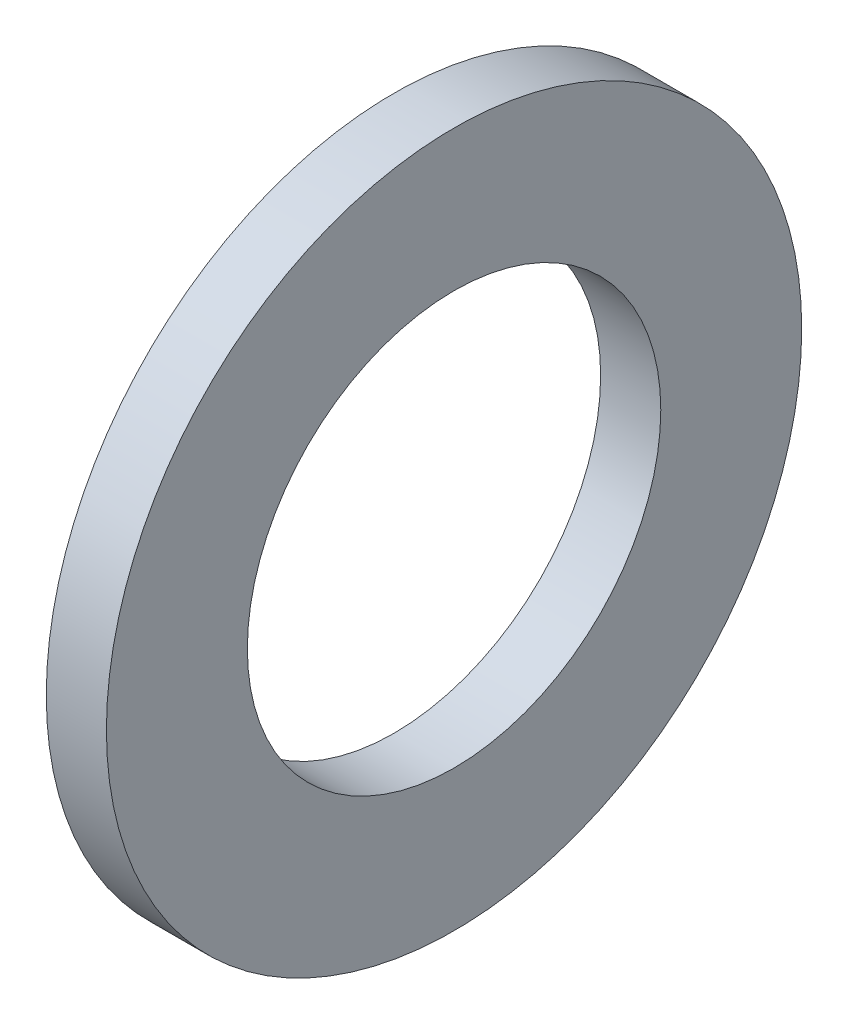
from build123d import *

# Parameters (mm, degrees)
SKETCH1_W = 3.2
SKETCH1_H = 7.5


with BuildPart() as part:
    # Sketch1 → Base-Revolve (revolve)
    with BuildSketch(Plane.XY, mode=Mode.PRIVATE) as base_revolve_sk:
        with Locations((-1.6, 14.75)):
            Rectangle(SKETCH1_W, SKETCH1_H)
    revolve(base_revolve_sk.sketch.rotate(Axis((-34.925, 0, 0), (1, 0, 0)), 90), axis=Axis((-34.925, 0, 0), (1, 0, 0)))


solid = part.part
